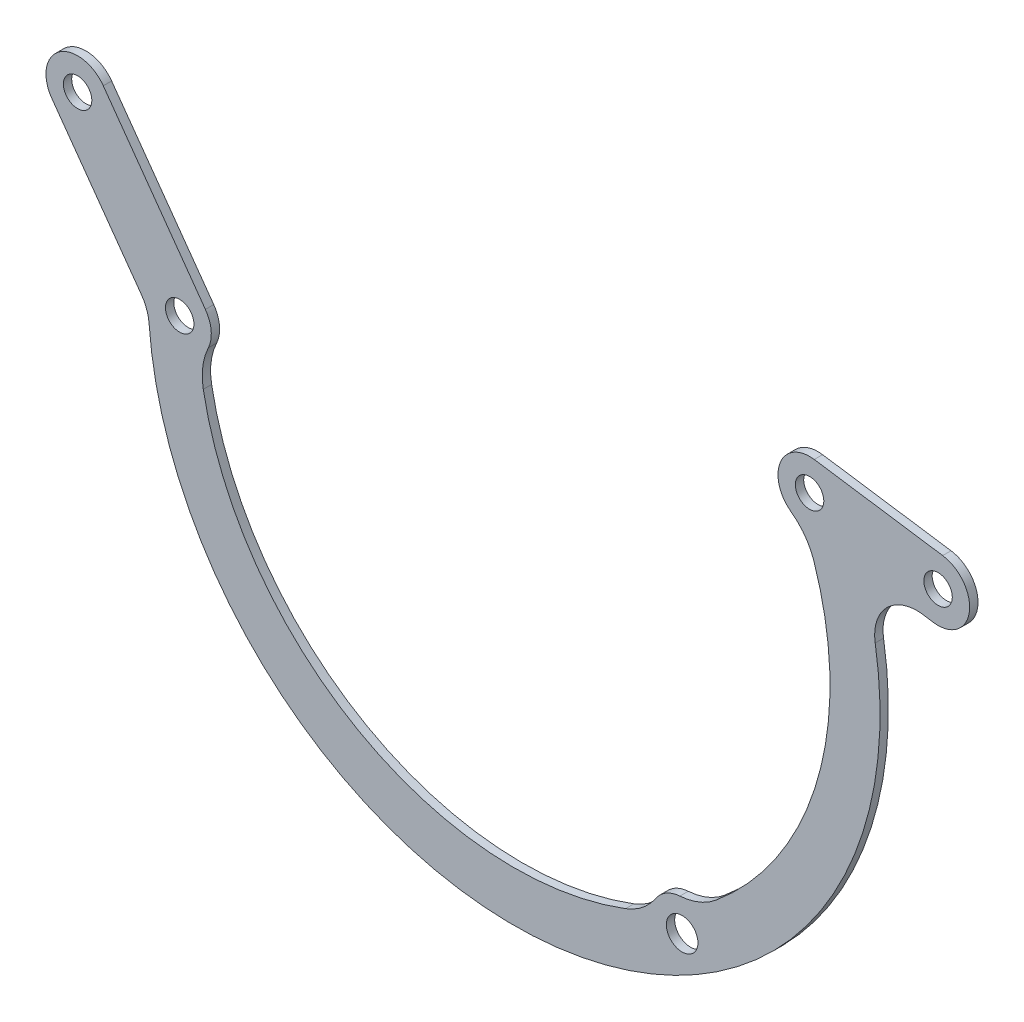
from build123d import *

# Parameters (mm, degrees)
SKETCH5_R           = 3.375
SKETCH5_R_2         = 7.5
BOSS_EXTRUDE2_DEPTH = 1.9812
FILLET1_R           = 10
SKETCH6_R           = 3.75
CUT_EXTRUDE1_DEPTH  = 244.153421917
CUT_EXTRUDE2_DEPTH  = 244.153421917


with BuildPart() as part:
    # Sketch5 → Boss-Extrude2 (new body)
    # profile 1 of 11: a face of its own
    with BuildSketch(Plane.XY):
        with BuildLine():
            ThreePointArc((-31.593495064, -2.911436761), (-34.825949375, -1.61645922), (-37.125172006, 0.998746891))
            ThreePointArc((-37.125172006, 0.998746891), (-30.891737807, -15.305181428), (-28.772259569, -32.630930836))
            ThreePointArc((-28.772259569, -32.630930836), (-38.346875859, -68.473256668), (-64.519805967, -94.766284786))
            ThreePointArc((-64.519805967, -94.766284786), (-57.009916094, -94.749094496), (-53.25, -101.25))
            ThreePointArc((-53.25, -101.25), (-54.249094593, -104.990084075), (-56.980194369, -107.733715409))
            ThreePointArc((-56.980194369, -107.733715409), (-25.345064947, -75.953424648), (-13.772259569, -32.630930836))
            ThreePointArc((-13.772259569, -32.630930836), (-14.918337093, -18.566194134), (-18.326330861, -4.872549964))
            Line((-18.326330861, -4.872549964), (-31.593495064, -2.911436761))
        make_face()
    # profile 2 of 11: a face of its own
    with BuildSketch(Plane.XY):
        with BuildLine():
            Line((1.096711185, 7.419381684), (-25.749911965, 11.387770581))
            ThreePointArc((-25.749911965, 11.387770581), (-24.790430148, 9.712908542), (-23.868395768, 8.017142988))
            ThreePointArc((-23.868395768, 8.017142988), (-20.836720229, 1.684362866), (-18.326330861, -4.872549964))
            Line((-18.326330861, -4.872549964), (-1.096711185, -7.419381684))
            ThreePointArc((-1.096711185, -7.419381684), (7.419381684, -1.096711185), (1.096711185, 7.419381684))
        make_face()
        Circle(SKETCH5_R, mode=Mode.SUBTRACT)
    # profile 3 of 11: a face of its own
    with BuildSketch(Plane.XY):
        with BuildLine():
            ThreePointArc((-18.326330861, -4.872549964), (-20.836720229, 1.684362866), (-23.868395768, 8.017142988))
            ThreePointArc((-23.868395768, 8.017142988), (-23.217947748, 6.315856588), (-22.996783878, 4.507944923))
            ThreePointArc((-22.996783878, 4.507944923), (-25.596545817, -1.169877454), (-31.593495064, -2.911436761))
            Line((-31.593495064, -2.911436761), (-18.326330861, -4.872549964))
        make_face()
    # profile 4 of 11: a face of its own
    with BuildSketch(Plane.XY):
        with BuildLine():
            ThreePointArc((-23.868395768, 8.017142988), (-26.167618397, 10.632349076), (-29.400072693, 11.927326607))
            ThreePointArc((-29.400072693, 11.927326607), (-36.621188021, 8.83711042), (-37.125172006, 0.998746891))
            ThreePointArc((-37.125172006, 0.998746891), (-34.825949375, -1.61645922), (-31.593495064, -2.911436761))
            ThreePointArc((-31.593495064, -2.911436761), (-25.596545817, -1.169877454), (-22.996783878, 4.507944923))
            ThreePointArc((-22.996783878, 4.507944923), (-23.217947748, 6.315856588), (-23.868395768, 8.017142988))
        make_face()
        with Locations((-30.496783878, 4.507944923)):
            Circle(SKETCH5_R, mode=Mode.SUBTRACT)
    # profile 5 of 11: a face of its own
    with BuildSketch(Plane.XY):
        with BuildLine():
            Line((-25.749911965, 11.387770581), (-29.400072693, 11.927326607))
            ThreePointArc((-29.400072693, 11.927326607), (-26.167618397, 10.632349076), (-23.868395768, 8.017142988))
            ThreePointArc((-23.868395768, 8.017142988), (-24.790430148, 9.712908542), (-25.749911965, 11.387770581))
        make_face()
    # profile 6 of 11: a face of its own
    with BuildSketch(Plane.XY):
        with BuildLine():
            ThreePointArc((-64.519805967, -94.766284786), (-136.009750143, -95.204474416), (-172.513206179, -33.734954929))
            ThreePointArc((-172.513206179, -33.734954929), (-172.512542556, -33.792554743), (-172.512321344, -33.850157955))
            ThreePointArc((-172.512321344, -33.850157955), (-177.719373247, -40.991053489), (-186.110291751, -38.216478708))
            Line((-186.110291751, -38.216478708), (-187.441743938, -36.356982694))
            ThreePointArc((-187.441743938, -36.356982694), (-142.344279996, -108.844776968), (-56.980194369, -107.733715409))
            ThreePointArc((-56.980194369, -107.733715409), (-67.233715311, -105.019805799), (-64.519805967, -94.766284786))
        make_face()
    # profile 7 of 11: a face of its own
    with BuildSketch(Plane.XY):
        with Locations((-60.75, -101.25)):
            Circle(SKETCH5_R_2)
        with Locations((-60.75, -101.25)):
            Circle(SKETCH5_R, mode=Mode.SUBTRACT)
    # profile 8 of 11: a face of its own
    with BuildSketch(Plane.XY):
        with BuildLine():
            ThreePointArc((-172.512321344, -33.850157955), (-172.512542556, -33.792554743), (-172.513206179, -33.734954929))
            ThreePointArc((-172.513206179, -33.734954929), (-172.889247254, -31.502432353), (-173.914350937, -29.483837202))
            ThreePointArc((-173.914350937, -29.483837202), (-182.360047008, -26.727083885), (-187.511436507, -33.96536111))
            ThreePointArc((-187.511436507, -33.96536111), (-187.135395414, -36.197883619), (-186.110291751, -38.216478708))
            ThreePointArc((-186.110291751, -38.216478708), (-177.719373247, -40.991053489), (-172.512321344, -33.850157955))
        make_face()
        with Locations((-180.012321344, -33.850157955)):
            Circle(SKETCH5_R, mode=Mode.SUBTRACT)
    # profile 9 of 11: a face of its own
    with BuildSketch(Plane.XY):
        with BuildLine():
            Line((-173.914350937, -29.483837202), (-185.381914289, -13.468325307))
            ThreePointArc((-185.381914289, -13.468325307), (-187.056585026, -23.653477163), (-187.511436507, -33.96536111))
            ThreePointArc((-187.511436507, -33.96536111), (-182.360047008, -26.727083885), (-173.914350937, -29.483837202))
        make_face()
    # profile 10 of 11: a face of its own
    with BuildSketch(Plane.XY):
        with BuildLine():
            ThreePointArc((-187.511436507, -33.96536111), (-187.056585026, -23.653477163), (-185.381914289, -13.468325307))
            Line((-185.381914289, -13.468325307), (-198.152029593, 4.366320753))
            ThreePointArc((-198.152029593, 4.366320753), (-208.616320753, 6.097970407), (-210.347970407, -4.366320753))
            Line((-210.347970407, -4.366320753), (-187.441743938, -36.356982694))
            ThreePointArc((-187.441743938, -36.356982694), (-187.484824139, -35.161411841), (-187.511436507, -33.96536111))
        make_face()
        with Locations((-204.25, 0)):
            Circle(SKETCH5_R, mode=Mode.SUBTRACT)
    # profile 11 of 11: a face of its own
    with BuildSketch(Plane.XY):
        with BuildLine():
            ThreePointArc((-186.110291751, -38.216478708), (-187.135395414, -36.197883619), (-187.511436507, -33.96536111))
            ThreePointArc((-187.511436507, -33.96536111), (-187.484824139, -35.161411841), (-187.441743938, -36.356982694))
            Line((-187.441743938, -36.356982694), (-186.110291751, -38.216478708))
        make_face()
    extrude(amount=BOSS_EXTRUDE2_DEPTH)

    # Fillet1
    fillet1_edges = [part.edges().sort_by_distance(p)[0] for p in [
        (-18.326330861, -4.872549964, 0.9906),
        (-187.441743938, -36.356982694, 0.9906),
    ]]
    fillet(fillet1_edges, radius=FILLET1_R)

    # Sketch6 → Cut-Extrude1 (cut, through all)
    with BuildSketch(Plane.XY.offset(1.9812)):
        with Locations((-60.75, -101.25)):
            Circle(SKETCH6_R)
    extrude(amount=-CUT_EXTRUDE1_DEPTH, mode=Mode.SUBTRACT)

    # Sketch7 → Cut-Extrude2 (cut, through all)
    with BuildSketch(Plane.XY.offset(1.9812)):
        with BuildLine():
            ThreePointArc((-64.519806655, -94.766285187), (-136.009750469, -95.204474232), (-172.513206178, -33.734954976))
            ThreePointArc((-172.513206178, -33.734954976), (-172.512542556, -33.792554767), (-172.512321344, -33.850157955))
            ThreePointArc((-172.512321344, -33.850157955), (-172.693769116, -35.489911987), (-173.229332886, -37.050324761))
            ThreePointArc((-173.229332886, -37.050324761), (-174.537262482, -41.509806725), (-174.417451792, -46.155590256))
            ThreePointArc((-174.417451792, -46.155590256), (-137.547409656, -97.925323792), (-74.177898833, -102.804915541))
            ThreePointArc((-74.177898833, -102.804915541), (-70.136177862, -100.510977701), (-66.990571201, -97.090039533))
            ThreePointArc((-66.990571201, -97.090039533), (-65.888275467, -95.786656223), (-64.519806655, -94.766285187))
        make_face()
        with BuildLine():
            ThreePointArc((-37.125172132, 0.998747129), (-31.544045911, -52.398578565), (-64.519806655, -94.766285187))
            ThreePointArc((-64.519806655, -94.766285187), (-62.956053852, -94.081783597), (-61.278022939, -93.768610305))
            ThreePointArc((-61.278022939, -93.768610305), (-56.748872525, -92.727238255), (-52.75584285, -90.349555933))
            ThreePointArc((-52.75584285, -90.349555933), (-32.76164755, -64.51482381), (-25.646972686, -32.630930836))
            ThreePointArc((-25.646972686, -32.630930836), (-26.610583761, -20.647061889), (-29.476655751, -8.971133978))
            ThreePointArc((-29.476655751, -8.971133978), (-31.608183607, -4.841455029), (-34.901428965, -1.562401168))
            ThreePointArc((-34.901428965, -1.562401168), (-36.159983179, -0.409185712), (-37.125172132, 0.998747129))
        make_face()
    extrude(amount=-CUT_EXTRUDE2_DEPTH, mode=Mode.SUBTRACT)


solid = part.part
